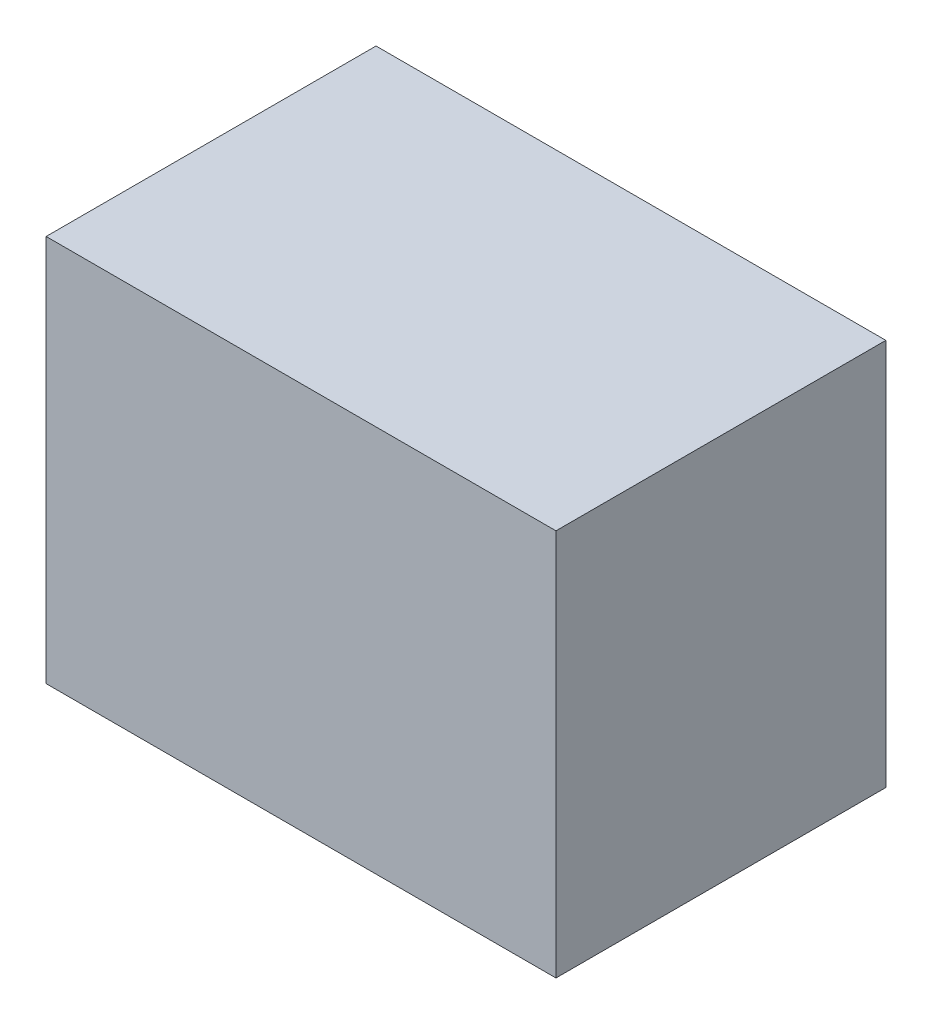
from build123d import *

# Parameters (mm, degrees)
SKETCH1_W           = 215.9
SKETCH1_H           = 139.7
BOSS_EXTRUDE1_DEPTH = 164


with BuildPart() as part:
    # Sketch1 → Boss-Extrude1 (new body)
    with BuildSketch(Plane(origin=(0, 0, 0), x_dir=(1, 0, 0), z_dir=(0, 1, 0))):
        Rectangle(SKETCH1_W, SKETCH1_H)
    extrude(amount=BOSS_EXTRUDE1_DEPTH)


solid = part.part
